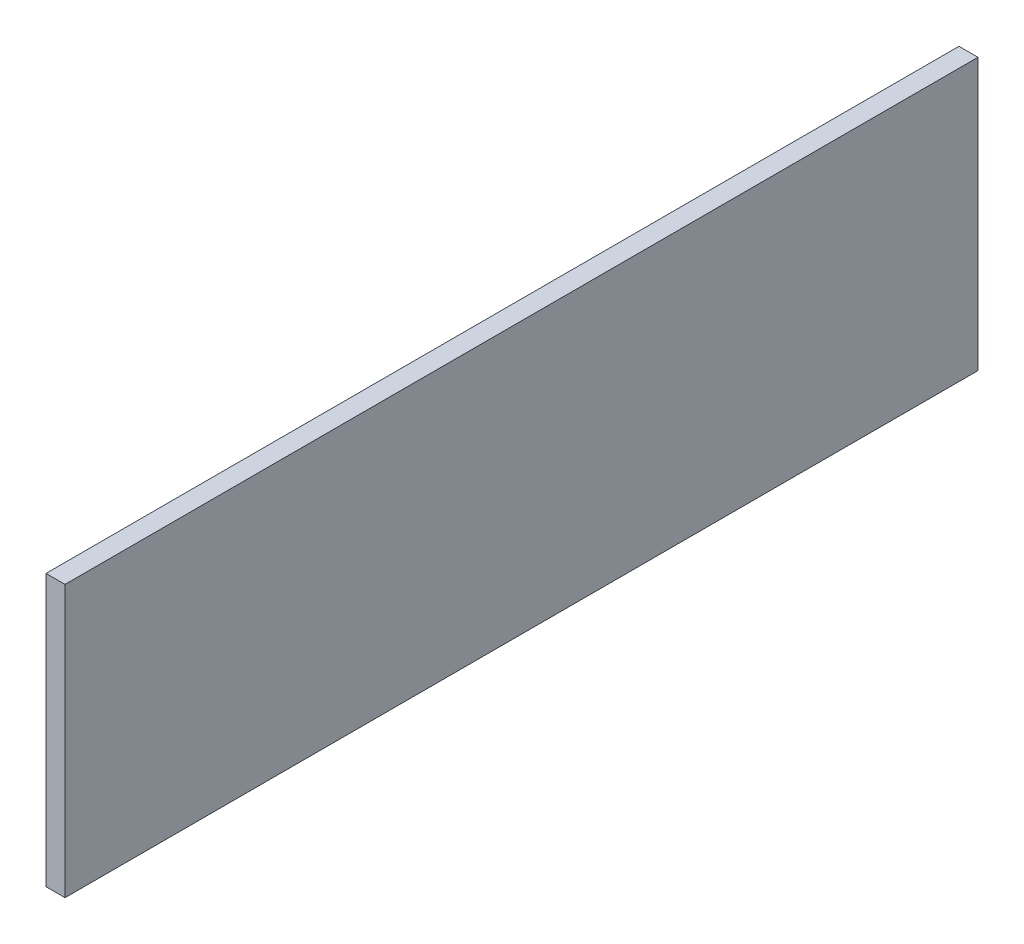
ISO-10303-21;
HEADER;
FILE_DESCRIPTION(('STEP AP214'),'2;1');
FILE_NAME('part.step','',(''),(''),'','','');
FILE_SCHEMA(('AUTOMOTIVE_DESIGN { 1 0 10303 214 1 1 1 1 }'));
ENDSEC;
DATA;
#1=APPLICATION_CONTEXT('core data for automotive mechanical design processes');
#2=APPLICATION_PROTOCOL_DEFINITION('international standard','automotive_design',2000,#1);
#3=PRODUCT_CONTEXT('',#1,'mechanical');
#4=PRODUCT('Part','Part','',(#3));
#5=PRODUCT_RELATED_PRODUCT_CATEGORY('part','',(#4));
#6=PRODUCT_DEFINITION_FORMATION('','',#4);
#7=PRODUCT_DEFINITION_CONTEXT('part definition',#1,'design');
#8=PRODUCT_DEFINITION('design','',#6,#7);
#9=PRODUCT_DEFINITION_SHAPE('','',#8);
#10=(LENGTH_UNIT() NAMED_UNIT(*) SI_UNIT(.MILLI.,.METRE.));
#11=(NAMED_UNIT(*) PLANE_ANGLE_UNIT() SI_UNIT($,.RADIAN.));
#12=(NAMED_UNIT(*) SI_UNIT($,.STERADIAN.) SOLID_ANGLE_UNIT());
#13=UNCERTAINTY_MEASURE_WITH_UNIT(LENGTH_MEASURE(1.E-05),#10,'distance_accuracy_value','');
#14=(GEOMETRIC_REPRESENTATION_CONTEXT(3) GLOBAL_UNCERTAINTY_ASSIGNED_CONTEXT((#13)) GLOBAL_UNIT_ASSIGNED_CONTEXT((#10,
#11,#12)) REPRESENTATION_CONTEXT('',''));
#15=CARTESIAN_POINT('',(0.,0.,0.));
#16=DIRECTION('',(0.,0.,1.));
#17=DIRECTION('',(1.,0.,0.));
#18=AXIS2_PLACEMENT_3D('',#15,#16,#17);
#19=CARTESIAN_POINT('',(-50.546,24.2358333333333,152.4));
#20=DIRECTION('',(1.,0.,0.));
#21=DIRECTION('',(0.,0.,-1.));
#22=AXIS2_PLACEMENT_3D('',#19,#20,#21);
#23=PLANE('',#22);
#24=DIRECTION('',(0.,-1.,0.));
#25=VECTOR('',#24,1.);
#26=CARTESIAN_POINT('',(-50.546,24.2358333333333,0.));
#27=LINE('',#26,#25);
#28=CARTESIAN_POINT('',(-50.546,24.2358333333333,0.));
#29=VERTEX_POINT('',#28);
#30=CARTESIAN_POINT('',(-50.546,-21.0608333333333,0.));
#31=VERTEX_POINT('',#30);
#32=EDGE_CURVE('E100',#29,#31,#27,.T.);
#33=ORIENTED_EDGE('',*,*,#32,.T.);
#34=DIRECTION('',(0.,0.,-1.));
#35=VECTOR('',#34,1.);
#36=CARTESIAN_POINT('',(-50.546,-21.0608333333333,152.4));
#37=LINE('',#36,#35);
#38=CARTESIAN_POINT('',(-50.546,-21.0608333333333,152.4));
#39=VERTEX_POINT('',#38);
#40=EDGE_CURVE('E11',#39,#31,#37,.T.);
#41=ORIENTED_EDGE('',*,*,#40,.F.);
#42=DIRECTION('',(0.,-1.,0.));
#43=VECTOR('',#42,1.);
#44=CARTESIAN_POINT('',(-50.546,24.2358333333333,152.4));
#45=LINE('',#44,#43);
#46=CARTESIAN_POINT('',(-50.546,24.2358333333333,152.4));
#47=VERTEX_POINT('',#46);
#48=EDGE_CURVE('E88',#47,#39,#45,.T.);
#49=ORIENTED_EDGE('',*,*,#48,.F.);
#50=DIRECTION('',(0.,0.,-1.));
#51=VECTOR('',#50,1.);
#52=CARTESIAN_POINT('',(-50.546,24.2358333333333,152.4));
#53=LINE('',#52,#51);
#54=EDGE_CURVE('E96',#47,#29,#53,.T.);
#55=ORIENTED_EDGE('',*,*,#54,.T.);
#56=EDGE_LOOP('',(#33,#41,#49,#55));
#57=FACE_BOUND('',#56,.T.);
#58=ADVANCED_FACE('F37',(#57),#23,.F.);
#59=CARTESIAN_POINT('',(-50.546,-21.0608333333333,152.4));
#60=DIRECTION('',(0.,1.,0.));
#61=DIRECTION('',(0.,0.,1.));
#62=AXIS2_PLACEMENT_3D('',#59,#60,#61);
#63=PLANE('',#62);
#64=DIRECTION('',(1.,0.,0.));
#65=VECTOR('',#64,1.);
#66=CARTESIAN_POINT('',(-50.546,-21.0608333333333,0.));
#67=LINE('',#66,#65);
#68=CARTESIAN_POINT('',(-47.371,-21.0608333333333,0.));
#69=VERTEX_POINT('',#68);
#70=EDGE_CURVE('E92',#31,#69,#67,.T.);
#71=ORIENTED_EDGE('',*,*,#70,.T.);
#72=DIRECTION('',(0.,0.,-1.));
#73=VECTOR('',#72,1.);
#74=CARTESIAN_POINT('',(-47.371,-21.0608333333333,152.4));
#75=LINE('',#74,#73);
#76=CARTESIAN_POINT('',(-47.371,-21.0608333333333,152.4));
#77=VERTEX_POINT('',#76);
#78=EDGE_CURVE('E45',#77,#69,#75,.T.);
#79=ORIENTED_EDGE('',*,*,#78,.F.);
#80=DIRECTION('',(1.,0.,0.));
#81=VECTOR('',#80,1.);
#82=CARTESIAN_POINT('',(-50.546,-21.0608333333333,152.4));
#83=LINE('',#82,#81);
#84=EDGE_CURVE('E83',#39,#77,#83,.T.);
#85=ORIENTED_EDGE('',*,*,#84,.F.);
#86=ORIENTED_EDGE('',*,*,#40,.T.);
#87=EDGE_LOOP('',(#71,#79,#85,#86));
#88=FACE_BOUND('',#87,.T.);
#89=ADVANCED_FACE('F91',(#88),#63,.F.);
#90=CARTESIAN_POINT('',(-47.371,24.2358333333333,152.4));
#91=DIRECTION('',(-1.,0.,0.));
#92=DIRECTION('',(0.,0.,1.));
#93=AXIS2_PLACEMENT_3D('',#90,#91,#92);
#94=PLANE('',#93);
#95=DIRECTION('',(0.,1.,0.));
#96=VECTOR('',#95,1.);
#97=CARTESIAN_POINT('',(-47.371,24.2358333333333,0.));
#98=LINE('',#97,#96);
#99=CARTESIAN_POINT('',(-47.371,24.2358333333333,0.));
#100=VERTEX_POINT('',#99);
#101=EDGE_CURVE('E70',#69,#100,#98,.T.);
#102=ORIENTED_EDGE('',*,*,#101,.T.);
#103=DIRECTION('',(0.,0.,-1.));
#104=VECTOR('',#103,1.);
#105=CARTESIAN_POINT('',(-47.371,24.2358333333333,152.4));
#106=LINE('',#105,#104);
#107=CARTESIAN_POINT('',(-47.371,24.2358333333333,152.4));
#108=VERTEX_POINT('',#107);
#109=EDGE_CURVE('E93',#108,#100,#106,.T.);
#110=ORIENTED_EDGE('',*,*,#109,.F.);
#111=DIRECTION('',(0.,1.,0.));
#112=VECTOR('',#111,1.);
#113=CARTESIAN_POINT('',(-47.371,24.2358333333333,152.4));
#114=LINE('',#113,#112);
#115=EDGE_CURVE('E86',#77,#108,#114,.T.);
#116=ORIENTED_EDGE('',*,*,#115,.F.);
#117=ORIENTED_EDGE('',*,*,#78,.T.);
#118=EDGE_LOOP('',(#102,#110,#116,#117));
#119=FACE_BOUND('',#118,.T.);
#120=ADVANCED_FACE('F94',(#119),#94,.F.);
#121=CARTESIAN_POINT('',(-50.546,24.2358333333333,152.4));
#122=DIRECTION('',(0.,-1.,0.));
#123=DIRECTION('',(1.,0.,0.));
#124=AXIS2_PLACEMENT_3D('',#121,#122,#123);
#125=PLANE('',#124);
#126=DIRECTION('',(-1.,0.,0.));
#127=VECTOR('',#126,1.);
#128=CARTESIAN_POINT('',(-50.546,24.2358333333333,0.));
#129=LINE('',#128,#127);
#130=EDGE_CURVE('E76',#100,#29,#129,.T.);
#131=ORIENTED_EDGE('',*,*,#130,.T.);
#132=ORIENTED_EDGE('',*,*,#54,.F.);
#133=DIRECTION('',(-1.,0.,0.));
#134=VECTOR('',#133,1.);
#135=CARTESIAN_POINT('',(-50.546,24.2358333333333,152.4));
#136=LINE('',#135,#134);
#137=EDGE_CURVE('E53',#108,#47,#136,.T.);
#138=ORIENTED_EDGE('',*,*,#137,.F.);
#139=ORIENTED_EDGE('',*,*,#109,.T.);
#140=EDGE_LOOP('',(#131,#132,#138,#139));
#141=FACE_BOUND('',#140,.T.);
#142=ADVANCED_FACE('F107',(#141),#125,.F.);
#143=CARTESIAN_POINT('',(0.,0.,152.4));
#144=DIRECTION('',(0.,0.,1.));
#145=DIRECTION('',(1.,0.,0.));
#146=AXIS2_PLACEMENT_3D('',#143,#144,#145);
#147=PLANE('',#146);
#148=ORIENTED_EDGE('',*,*,#48,.T.);
#149=ORIENTED_EDGE('',*,*,#84,.T.);
#150=ORIENTED_EDGE('',*,*,#115,.T.);
#151=ORIENTED_EDGE('',*,*,#137,.T.);
#152=EDGE_LOOP('',(#148,#149,#150,#151));
#153=FACE_BOUND('',#152,.T.);
#154=ADVANCED_FACE('F84',(#153),#147,.T.);
#155=CARTESIAN_POINT('',(0.,0.,0.));
#156=DIRECTION('',(0.,0.,1.));
#157=DIRECTION('',(1.,0.,0.));
#158=AXIS2_PLACEMENT_3D('',#155,#156,#157);
#159=PLANE('',#158);
#160=ORIENTED_EDGE('',*,*,#32,.F.);
#161=ORIENTED_EDGE('',*,*,#130,.F.);
#162=ORIENTED_EDGE('',*,*,#101,.F.);
#163=ORIENTED_EDGE('',*,*,#70,.F.);
#164=EDGE_LOOP('',(#160,#161,#162,#163));
#165=FACE_BOUND('',#164,.T.);
#166=ADVANCED_FACE('F110',(#165),#159,.F.);
#167=CLOSED_SHELL('',(#58,#89,#120,#142,#154,#166));
#168=MANIFOLD_SOLID_BREP('B2',#167);
#169=ADVANCED_BREP_SHAPE_REPRESENTATION('',(#18,#168),#14);
#170=SHAPE_DEFINITION_REPRESENTATION(#9,#169);
ENDSEC;
END-ISO-10303-21;
